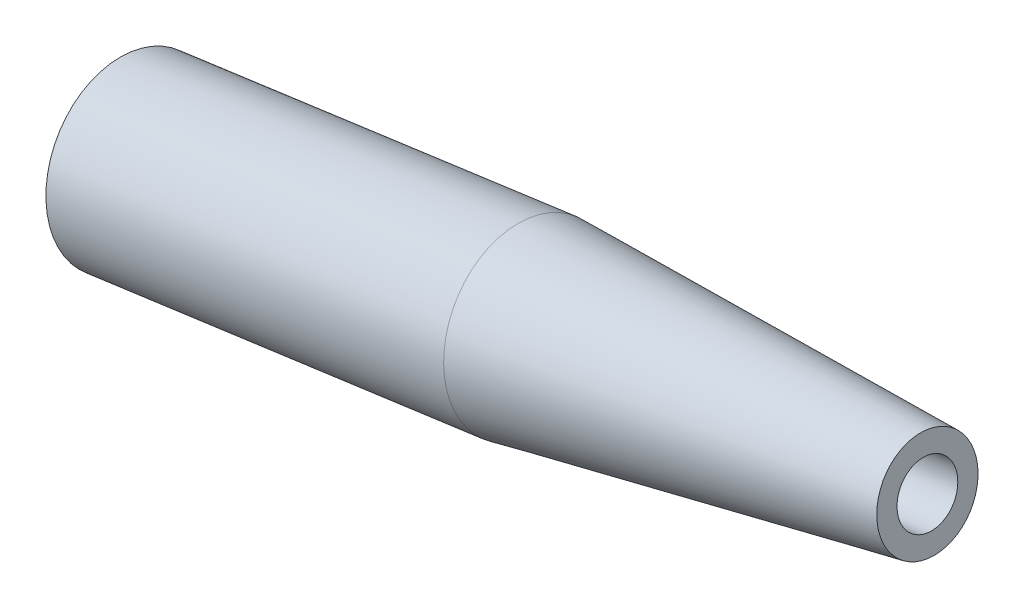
ISO-10303-21;
HEADER;
FILE_DESCRIPTION(('STEP AP214'),'2;1');
FILE_NAME('part.step','',(''),(''),'','','');
FILE_SCHEMA(('AUTOMOTIVE_DESIGN { 1 0 10303 214 1 1 1 1 }'));
ENDSEC;
DATA;
#1=APPLICATION_CONTEXT('core data for automotive mechanical design processes');
#2=APPLICATION_PROTOCOL_DEFINITION('international standard','automotive_design',2000,#1);
#3=PRODUCT_CONTEXT('',#1,'mechanical');
#4=PRODUCT('Part','Part','',(#3));
#5=PRODUCT_RELATED_PRODUCT_CATEGORY('part','',(#4));
#6=PRODUCT_DEFINITION_FORMATION('','',#4);
#7=PRODUCT_DEFINITION_CONTEXT('part definition',#1,'design');
#8=PRODUCT_DEFINITION('design','',#6,#7);
#9=PRODUCT_DEFINITION_SHAPE('','',#8);
#10=(LENGTH_UNIT() NAMED_UNIT(*) SI_UNIT(.MILLI.,.METRE.));
#11=(NAMED_UNIT(*) PLANE_ANGLE_UNIT() SI_UNIT($,.RADIAN.));
#12=(NAMED_UNIT(*) SI_UNIT($,.STERADIAN.) SOLID_ANGLE_UNIT());
#13=UNCERTAINTY_MEASURE_WITH_UNIT(LENGTH_MEASURE(1.E-05),#10,'distance_accuracy_value','');
#14=(GEOMETRIC_REPRESENTATION_CONTEXT(3) GLOBAL_UNCERTAINTY_ASSIGNED_CONTEXT((#13)) GLOBAL_UNIT_ASSIGNED_CONTEXT((#10,
#11,#12)) REPRESENTATION_CONTEXT('',''));
#15=CARTESIAN_POINT('',(0.,0.,0.));
#16=DIRECTION('',(0.,0.,1.));
#17=DIRECTION('',(1.,0.,0.));
#18=AXIS2_PLACEMENT_3D('',#15,#16,#17);
#19=CARTESIAN_POINT('',(49.1743055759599,5.8737254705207,-13.51));
#20=DIRECTION('',(0.99065880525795,0.136363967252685,0.));
#21=DIRECTION('',(-0.136363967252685,0.99065880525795,0.));
#22=AXIS2_PLACEMENT_3D('',#19,#20,#21);
#23=CYLINDRICAL_SURFACE('',#22,0.299999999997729);
#24=CARTESIAN_POINT('',(52.1462878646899,6.28281818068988,-13.51));
#25=DIRECTION('',(0.99065880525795,0.136363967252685,0.));
#26=DIRECTION('',(-0.136363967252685,0.99065880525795,0.));
#27=AXIS2_PLACEMENT_3D('',#24,#25,#26);
#28=CIRCLE('',#27,0.299999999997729);
#29=CARTESIAN_POINT('',(52.1053786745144,6.58001582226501,-13.51));
#30=VERTEX_POINT('',#29);
#31=EDGE_CURVE('E21',#30,#30,#28,.T.);
#32=ORIENTED_EDGE('',*,*,#31,.T.);
#33=EDGE_LOOP('',(#32));
#34=FACE_BOUND('',#33,.T.);
#35=CARTESIAN_POINT('',(49.1743053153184,5.87372543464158,-13.51));
#36=DIRECTION('',(-0.990658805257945,-0.136363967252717,0.));
#37=DIRECTION('',(0.136363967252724,-0.990658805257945,0.));
#38=AXIS2_PLACEMENT_3D('',#35,#36,#37);
#39=CIRCLE('',#38,0.299998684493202);
#40=CARTESIAN_POINT('',(49.2152143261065,5.57652909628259,-13.51));
#41=VERTEX_POINT('',#40);
#42=EDGE_CURVE('E95',#41,#41,#39,.T.);
#43=ORIENTED_EDGE('',*,*,#42,.T.);
#44=EDGE_LOOP('',(#43));
#45=FACE_BOUND('',#44,.T.);
#46=ADVANCED_FACE('F16',(#34,#45),#23,.F.);
#47=CARTESIAN_POINT('',(49.1743053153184,5.87372543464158,-13.51));
#48=DIRECTION('',(-0.990658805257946,-0.136363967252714,0.));
#49=DIRECTION('',(0.136363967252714,-0.990658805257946,0.));
#50=AXIS2_PLACEMENT_3D('',#47,#48,#49);
#51=CONICAL_SURFACE('',#50,0.299998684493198,0.197393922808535);
#52=ORIENTED_EDGE('',*,*,#42,.F.);
#53=EDGE_LOOP('',(#52));
#54=FACE_BOUND('',#53,.T.);
#55=CARTESIAN_POINT('',(48.1836522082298,5.73736225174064,-13.51));
#56=DIRECTION('',(-0.990658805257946,-0.136363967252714,0.));
#57=DIRECTION('',(0.136363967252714,-0.990658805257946,0.));
#58=AXIS2_PLACEMENT_3D('',#55,#56,#57);
#59=CIRCLE('',#58,0.499995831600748);
#60=CARTESIAN_POINT('',(48.2518336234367,5.24203697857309,-13.51));
#61=VERTEX_POINT('',#60);
#62=EDGE_CURVE('E124',#61,#61,#59,.T.);
#63=ORIENTED_EDGE('',*,*,#62,.T.);
#64=EDGE_LOOP('',(#63));
#65=FACE_BOUND('',#64,.T.);
#66=ADVANCED_FACE('F137',(#54,#65),#51,.F.);
#67=CARTESIAN_POINT('',(52.21728531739,5.767034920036,-12.99));
#68=DIRECTION('',(0.990658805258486,0.136363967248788,0.));
#69=DIRECTION('',(0.,0.,-1.));
#70=AXIS2_PLACEMENT_3D('',#67,#68,#69);
#71=PLANE('',#70);
#72=ORIENTED_EDGE('',*,*,#31,.F.);
#73=EDGE_LOOP('',(#72));
#74=FACE_BOUND('',#73,.T.);
#75=CARTESIAN_POINT('',(52.1462876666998,6.28281815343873,-13.51));
#76=DIRECTION('',(-0.990658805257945,-0.136363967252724,0.));
#77=DIRECTION('',(0.136363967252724,-0.990658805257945,0.));
#78=AXIS2_PLACEMENT_3D('',#75,#76,#77);
#79=CIRCLE('',#78,0.499997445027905);
#80=CARTESIAN_POINT('',(52.21446930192,5.78749128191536,-13.51));
#81=VERTEX_POINT('',#80);
#82=EDGE_CURVE('E122',#81,#81,#79,.F.);
#83=ORIENTED_EDGE('',*,*,#82,.T.);
#84=EDGE_LOOP('',(#83));
#85=FACE_BOUND('',#84,.T.);
#86=ADVANCED_FACE('F133',(#74,#85),#71,.T.);
#87=CARTESIAN_POINT('',(48.09856152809,6.355533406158,-14.13498905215));
#88=DIRECTION('',(-0.990658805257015,-0.136363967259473,0.));
#89=DIRECTION('',(0.136363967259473,-0.990658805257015,0.));
#90=AXIS2_PLACEMENT_3D('',#87,#88,#89);
#91=PLANE('',#90);
#92=ORIENTED_EDGE('',*,*,#62,.F.);
#93=EDGE_LOOP('',(#92));
#94=FACE_BOUND('',#93,.T.);
#95=CARTESIAN_POINT('',(48.1836526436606,5.7373623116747,-13.51));
#96=DIRECTION('',(-0.990658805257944,-0.136363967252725,0.));
#97=DIRECTION('',(0.136363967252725,-0.990658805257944,0.));
#98=AXIS2_PLACEMENT_3D('',#95,#96,#97);
#99=CIRCLE('',#98,0.599999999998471);
#100=CARTESIAN_POINT('',(48.265471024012,5.14296702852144,-13.51));
#101=VERTEX_POINT('',#100);
#102=EDGE_CURVE('E94',#101,#101,#99,.T.);
#103=ORIENTED_EDGE('',*,*,#102,.T.);
#104=EDGE_LOOP('',(#103));
#105=FACE_BOUND('',#104,.T.);
#106=ADVANCED_FACE('F136',(#94,#105),#91,.T.);
#107=CARTESIAN_POINT('',(52.1462876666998,6.28281815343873,-13.51));
#108=DIRECTION('',(-0.990658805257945,-0.136363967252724,0.));
#109=DIRECTION('',(0.136363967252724,-0.990658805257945,0.));
#110=AXIS2_PLACEMENT_3D('',#107,#108,#109);
#111=CONICAL_SURFACE('',#110,0.499997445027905,0.0872772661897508);
#112=CARTESIAN_POINT('',(48.1836474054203,5.73736159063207,-13.51));
#113=DIRECTION('',(0.990658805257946,0.136363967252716,0.));
#114=DIRECTION('',(-4.08170229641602E-13,2.96433629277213E-12,-1.));
#115=AXIS2_PLACEMENT_3D('',#112,#113,#114);
#116=CIRCLE('',#115,0.85);
#117=CARTESIAN_POINT('',(48.1836474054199,5.73736159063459,-14.36));
#118=VERTEX_POINT('',#117);
#119=EDGE_CURVE('E49',#118,#118,#116,.T.);
#120=ORIENTED_EDGE('',*,*,#119,.T.);
#121=EDGE_LOOP('',(#120));
#122=FACE_BOUND('',#121,.T.);
#123=ORIENTED_EDGE('',*,*,#82,.F.);
#124=EDGE_LOOP('',(#123));
#125=FACE_BOUND('',#124,.T.);
#126=ADVANCED_FACE('F141',(#122,#125),#111,.T.);
#127=CARTESIAN_POINT('',(48.1836526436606,5.7373623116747,-13.51));
#128=DIRECTION('',(-0.990658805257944,-0.136363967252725,0.));
#129=DIRECTION('',(0.136363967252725,-0.990658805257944,0.));
#130=AXIS2_PLACEMENT_3D('',#127,#128,#129);
#131=CYLINDRICAL_SURFACE('',#130,0.599999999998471);
#132=ORIENTED_EDGE('',*,*,#102,.F.);
#133=EDGE_LOOP('',(#132));
#134=FACE_BOUND('',#133,.T.);
#135=CARTESIAN_POINT('',(44.4191491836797,5.21917923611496,-13.51));
#136=DIRECTION('',(-0.990658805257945,-0.136363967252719,0.));
#137=DIRECTION('',(0.13630091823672,-0.990200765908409,0.0304056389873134));
#138=AXIS2_PLACEMENT_3D('',#135,#136,#137);
#139=CIRCLE('',#138,0.600000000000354);
#140=CARTESIAN_POINT('',(44.3373308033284,5.81357451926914,-13.5100000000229));
#141=VERTEX_POINT('',#140);
#142=CARTESIAN_POINT('',(44.5009675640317,4.62478395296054,-13.5099999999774));
#143=VERTEX_POINT('',#142);
#144=EDGE_CURVE('E43',#141,#143,#139,.T.);
#145=ORIENTED_EDGE('',*,*,#144,.T.);
#146=CARTESIAN_POINT('',(44.4191491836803,5.21917923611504,-13.51));
#147=DIRECTION('',(-0.990658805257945,-0.136363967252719,0.));
#148=DIRECTION('',(-0.136300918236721,0.990200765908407,-0.0304056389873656));
#149=AXIS2_PLACEMENT_3D('',#146,#147,#148);
#150=CIRCLE('',#149,0.599999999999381);
#151=EDGE_CURVE('E48',#143,#141,#150,.T.);
#152=ORIENTED_EDGE('',*,*,#151,.T.);
#153=EDGE_LOOP('',(#145,#152));
#154=FACE_BOUND('',#153,.T.);
#155=ADVANCED_FACE('F47',(#134,#154),#131,.F.);
#156=CARTESIAN_POINT('',(44.22101742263,5.191906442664,-13.51));
#157=DIRECTION('',(0.990658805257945,0.136363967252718,0.));
#158=DIRECTION('',(-0.136363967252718,0.990658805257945,0.));
#159=AXIS2_PLACEMENT_3D('',#156,#157,#158);
#160=CYLINDRICAL_SURFACE('',#159,0.850000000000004);
#161=CARTESIAN_POINT('',(44.22101742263,5.191906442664,-13.51));
#162=DIRECTION('',(0.990658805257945,0.136363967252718,0.));
#163=DIRECTION('',(-0.136363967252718,0.990658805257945,0.));
#164=AXIS2_PLACEMENT_3D('',#161,#162,#163);
#165=CIRCLE('',#164,0.850000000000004);
#166=CARTESIAN_POINT('',(44.1051080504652,6.03396642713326,-13.51));
#167=VERTEX_POINT('',#166);
#168=EDGE_CURVE('E112',#167,#167,#165,.T.);
#169=ORIENTED_EDGE('',*,*,#168,.T.);
#170=EDGE_LOOP('',(#169));
#171=FACE_BOUND('',#170,.T.);
#172=ORIENTED_EDGE('',*,*,#119,.F.);
#173=EDGE_LOOP('',(#172));
#174=FACE_BOUND('',#173,.T.);
#175=ADVANCED_FACE('F76',(#171,#174),#160,.T.);
#176=CARTESIAN_POINT('',(44.3316727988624,4.38985777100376,-13.485370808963));
#177=CARTESIAN_POINT('',(44.3081380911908,4.51428443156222,-13.4892181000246));
#178=CARTESIAN_POINT('',(44.3846749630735,4.61520700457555,-13.4919419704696));
#179=CARTESIAN_POINT('',(44.5108903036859,4.62617644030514,-13.4917489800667));
#180=(BOUNDED_CURVE() B_SPLINE_CURVE(3,(#176,#177,#178,#179),.UNSPECIFIED.,.F.,
.F.) B_SPLINE_CURVE_WITH_KNOTS((4,4),(0.,1.),
.UNSPECIFIED.) CURVE() GEOMETRIC_REPRESENTATION_ITEM() RATIONAL_B_SPLINE_CURVE((1.,
0.78052795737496,0.78052795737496,1.)) REPRESENTATION_ITEM(''));
#181=CARTESIAN_POINT('',(44.41914918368,5.219179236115,-13.51));
#182=DIRECTION('',(-0.990658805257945,-0.136363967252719,0.));
#183=AXIS1_PLACEMENT('',#181,#182);
#184=SURFACE_OF_REVOLUTION('',#180,#183);
#185=ORIENTED_EDGE('',*,*,#144,.F.);
#186=CARTESIAN_POINT('',(44.3100580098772,6.01170628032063,-13.5100000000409));
#187=DIRECTION('',(7.03172420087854E-12,-5.11081401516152E-11,-1.));
#188=DIRECTION('',(0.,1.,-5.11081401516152E-11));
#189=AXIS2_PLACEMENT_3D('',#186,#187,#188);
#190=CIRCLE('',#189,0.199999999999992);
#191=CARTESIAN_POINT('',(44.1119262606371,5.98443340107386,-13.5100000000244));
#192=VERTEX_POINT('',#191);
#193=EDGE_CURVE('E52',#141,#192,#190,.T.);
#194=ORIENTED_EDGE('',*,*,#193,.T.);
#195=CARTESIAN_POINT('',(44.221017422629,5.19190644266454,-13.51));
#196=DIRECTION('',(-0.990658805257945,-0.136363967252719,0.));
#197=DIRECTION('',(-0.136363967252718,0.990658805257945,-5.00012396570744E-11));
#198=AXIS2_PLACEMENT_3D('',#195,#196,#197);
#199=CIRCLE('',#198,0.799999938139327);
#200=CARTESIAN_POINT('',(44.3301085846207,4.39937948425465,-13.5099999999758));
#201=VERTEX_POINT('',#200);
#202=EDGE_CURVE('E27',#192,#201,#199,.T.);
#203=ORIENTED_EDGE('',*,*,#202,.T.);
#204=CARTESIAN_POINT('',(44.5282403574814,4.42665219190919,-13.50999999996));
#205=DIRECTION('',(6.87291203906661E-12,-4.99958183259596E-11,-1.));
#206=DIRECTION('',(0.,1.,-4.99958183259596E-11));
#207=AXIS2_PLACEMENT_3D('',#204,#205,#206);
#208=CIRCLE('',#207,0.199999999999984);
#209=EDGE_CURVE('E34',#201,#143,#208,.T.);
#210=ORIENTED_EDGE('',*,*,#209,.T.);
#211=EDGE_LOOP('',(#185,#194,#203,#210));
#212=FACE_BOUND('',#211,.T.);
#213=ADVANCED_FACE('F55',(#212),#184,.T.);
#214=CARTESIAN_POINT('',(44.1108597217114,5.99402361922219,-13.534629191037));
#215=CARTESIAN_POINT('',(44.1218179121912,5.86786580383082,-13.5307818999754));
#216=CARTESIAN_POINT('',(44.2227756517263,5.79137532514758,-13.5280580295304));
#217=CARTESIAN_POINT('',(44.347260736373,5.81491474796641,-13.5282510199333));
#218=(BOUNDED_CURVE() B_SPLINE_CURVE(3,(#214,#215,#216,#217),.UNSPECIFIED.,.F.,
.F.) B_SPLINE_CURVE_WITH_KNOTS((4,4),(0.,1.),
.UNSPECIFIED.) CURVE() GEOMETRIC_REPRESENTATION_ITEM() RATIONAL_B_SPLINE_CURVE((1.,
0.780527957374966,0.780527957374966,1.)) REPRESENTATION_ITEM(''));
#219=CARTESIAN_POINT('',(44.41914918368,5.219179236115,-13.51));
#220=DIRECTION('',(-0.990658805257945,-0.136363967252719,0.));
#221=AXIS1_PLACEMENT('',#219,#220);
#222=SURFACE_OF_REVOLUTION('',#218,#221);
#223=ORIENTED_EDGE('',*,*,#151,.F.);
#224=ORIENTED_EDGE('',*,*,#209,.F.);
#225=CARTESIAN_POINT('',(44.2210174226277,5.19190644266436,-13.51));
#226=DIRECTION('',(-0.990658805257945,-0.136363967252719,0.));
#227=DIRECTION('',(0.136363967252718,-0.990658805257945,4.99969028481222E-11));
#228=AXIS2_PLACEMENT_3D('',#225,#226,#227);
#229=CIRCLE('',#228,0.799999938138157);
#230=EDGE_CURVE('E11',#201,#192,#229,.T.);
#231=ORIENTED_EDGE('',*,*,#230,.T.);
#232=ORIENTED_EDGE('',*,*,#193,.F.);
#233=EDGE_LOOP('',(#223,#224,#231,#232));
#234=FACE_BOUND('',#233,.T.);
#235=ADVANCED_FACE('F51',(#234),#222,.T.);
#236=CARTESIAN_POINT('',(44.34156316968,4.316164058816,-12.626));
#237=DIRECTION('',(0.990658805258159,0.136363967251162,0.));
#238=DIRECTION('',(0.,0.,-1.));
#239=AXIS2_PLACEMENT_3D('',#236,#237,#238);
#240=PLANE('',#239);
#241=ORIENTED_EDGE('',*,*,#202,.F.);
#242=ORIENTED_EDGE('',*,*,#230,.F.);
#243=EDGE_LOOP('',(#241,#242));
#244=FACE_BOUND('',#243,.T.);
#245=ORIENTED_EDGE('',*,*,#168,.F.);
#246=EDGE_LOOP('',(#245));
#247=FACE_BOUND('',#246,.T.);
#248=ADVANCED_FACE('F18',(#244,#247),#240,.F.);
#249=CLOSED_SHELL('',(#46,#66,#86,#106,#126,#155,#175,#213,#235,#248));
#250=MANIFOLD_SOLID_BREP('B1',#249);
#251=ADVANCED_BREP_SHAPE_REPRESENTATION('',(#18,#250),#14);
#252=SHAPE_DEFINITION_REPRESENTATION(#9,#251);
ENDSEC;
END-ISO-10303-21;
